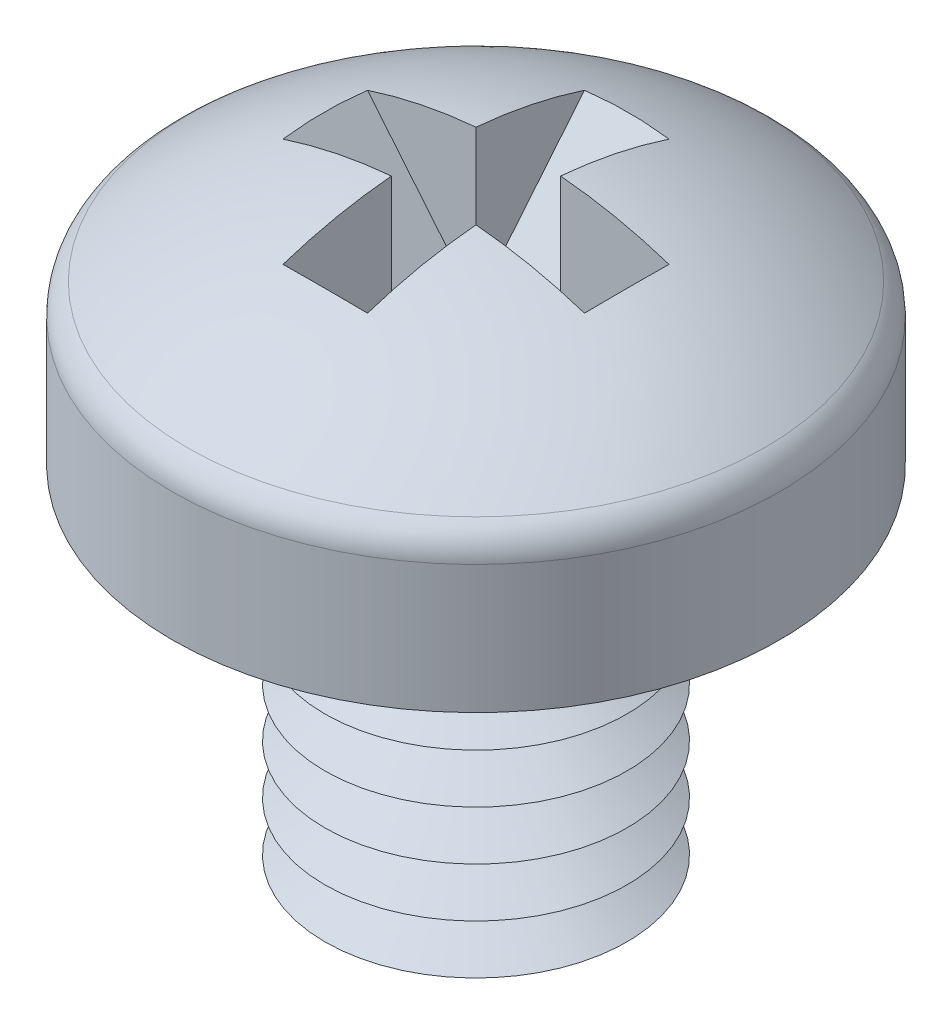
ISO-10303-21;
HEADER;
FILE_DESCRIPTION(('STEP AP214'),'2;1');
FILE_NAME('part.step','',(''),(''),'','','');
FILE_SCHEMA(('AUTOMOTIVE_DESIGN { 1 0 10303 214 1 1 1 1 }'));
ENDSEC;
DATA;
#1=APPLICATION_CONTEXT('core data for automotive mechanical design processes');
#2=APPLICATION_PROTOCOL_DEFINITION('international standard','automotive_design',2000,#1);
#3=PRODUCT_CONTEXT('',#1,'mechanical');
#4=PRODUCT('Part','Part','',(#3));
#5=PRODUCT_RELATED_PRODUCT_CATEGORY('part','',(#4));
#6=PRODUCT_DEFINITION_FORMATION('','',#4);
#7=PRODUCT_DEFINITION_CONTEXT('part definition',#1,'design');
#8=PRODUCT_DEFINITION('design','',#6,#7);
#9=PRODUCT_DEFINITION_SHAPE('','',#8);
#10=(LENGTH_UNIT() NAMED_UNIT(*) SI_UNIT(.MILLI.,.METRE.));
#11=(NAMED_UNIT(*) PLANE_ANGLE_UNIT() SI_UNIT($,.RADIAN.));
#12=(NAMED_UNIT(*) SI_UNIT($,.STERADIAN.) SOLID_ANGLE_UNIT());
#13=UNCERTAINTY_MEASURE_WITH_UNIT(LENGTH_MEASURE(1.E-05),#10,'distance_accuracy_value','');
#14=(GEOMETRIC_REPRESENTATION_CONTEXT(3) GLOBAL_UNCERTAINTY_ASSIGNED_CONTEXT((#13)) GLOBAL_UNIT_ASSIGNED_CONTEXT((#10,
#11,#12)) REPRESENTATION_CONTEXT('',''));
#15=CARTESIAN_POINT('',(0.,0.,0.));
#16=DIRECTION('',(0.,0.,1.));
#17=DIRECTION('',(1.,0.,0.));
#18=AXIS2_PLACEMENT_3D('',#15,#16,#17);
#19=CARTESIAN_POINT('',(1.425,2.1,-0.35));
#20=DIRECTION('',(0.771865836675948,-0.635785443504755,0.));
#21=DIRECTION('',(0.635785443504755,0.771865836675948,0.));
#22=AXIS2_PLACEMENT_3D('',#19,#20,#21);
#23=PLANE('',#22);
#24=DIRECTION('',(0.,0.,-1.));
#25=VECTOR('',#24,1.);
#26=CARTESIAN_POINT('',(0.35,0.794912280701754,-0.35));
#27=LINE('',#26,#25);
#28=CARTESIAN_POINT('',(0.35,0.794912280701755,0.35));
#29=VERTEX_POINT('',#28);
#30=CARTESIAN_POINT('',(0.35,0.794912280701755,-0.35));
#31=VERTEX_POINT('',#30);
#32=EDGE_CURVE('E137',#29,#31,#27,.T.);
#33=ORIENTED_EDGE('',*,*,#32,.F.);
#34=DIRECTION('',(0.635785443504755,0.771865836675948,0.));
#35=VECTOR('',#34,1.);
#36=CARTESIAN_POINT('',(1.425,2.1,0.35));
#37=LINE('',#36,#35);
#38=CARTESIAN_POINT('',(1.24787904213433,1.88496894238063,0.35));
#39=VERTEX_POINT('',#38);
#40=EDGE_CURVE('E178',#29,#39,#37,.T.);
#41=ORIENTED_EDGE('',*,*,#40,.T.);
#42=CARTESIAN_POINT('',(-1.12047731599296,-0.990298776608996,0.));
#43=DIRECTION('',(0.771865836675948,-0.635785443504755,0.));
#44=DIRECTION('',(0.635785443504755,0.771865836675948,0.));
#45=AXIS2_PLACEMENT_3D('',#42,#43,#44);
#46=CIRCLE('',#45,3.74149385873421);
#47=CARTESIAN_POINT('',(1.24787904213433,1.88496894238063,-0.35));
#48=VERTEX_POINT('',#47);
#49=EDGE_CURVE('E259',#39,#48,#46,.F.);
#50=ORIENTED_EDGE('',*,*,#49,.T.);
#51=DIRECTION('',(0.635785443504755,0.771865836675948,0.));
#52=VECTOR('',#51,1.);
#53=CARTESIAN_POINT('',(1.425,2.1,-0.35));
#54=LINE('',#53,#52);
#55=EDGE_CURVE('E184',#31,#48,#54,.T.);
#56=ORIENTED_EDGE('',*,*,#55,.F.);
#57=EDGE_LOOP('',(#33,#41,#50,#56));
#58=FACE_BOUND('',#57,.T.);
#59=ADVANCED_FACE('F31',(#58),#23,.F.);
#60=CARTESIAN_POINT('',(-1.425,3.15,-0.35));
#61=DIRECTION('',(0.,0.,-1.));
#62=DIRECTION('',(-1.,0.,0.));
#63=AXIS2_PLACEMENT_3D('',#60,#61,#62);
#64=PLANE('',#63);
#65=DIRECTION('',(0.635785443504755,-0.771865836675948,0.));
#66=VECTOR('',#65,1.);
#67=CARTESIAN_POINT('',(0.,0.37,-0.35));
#68=LINE('',#67,#66);
#69=CARTESIAN_POINT('',(-1.24787904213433,1.88496894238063,-0.35));
#70=VERTEX_POINT('',#69);
#71=CARTESIAN_POINT('',(-0.35,0.794912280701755,-0.35));
#72=VERTEX_POINT('',#71);
#73=EDGE_CURVE('E182',#70,#72,#68,.T.);
#74=ORIENTED_EDGE('',*,*,#73,.T.);
#75=DIRECTION('',(0.,1.,0.));
#76=VECTOR('',#75,1.);
#77=CARTESIAN_POINT('',(-0.35,3.15,-0.35));
#78=LINE('',#77,#76);
#79=CARTESIAN_POINT('',(-0.35,2.06935902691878,-0.35));
#80=VERTEX_POINT('',#79);
#81=EDGE_CURVE('E158',#72,#80,#78,.T.);
#82=ORIENTED_EDGE('',*,*,#81,.T.);
#83=CARTESIAN_POINT('',(0.,-1.91323529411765,-0.35));
#84=DIRECTION('',(0.,0.,-1.));
#85=DIRECTION('',(-1.,0.,0.));
#86=AXIS2_PLACEMENT_3D('',#83,#84,#85);
#87=CIRCLE('',#86,3.99794416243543);
#88=EDGE_CURVE('E262',#80,#70,#87,.F.);
#89=ORIENTED_EDGE('',*,*,#88,.T.);
#90=EDGE_LOOP('',(#74,#82,#89));
#91=FACE_BOUND('',#90,.T.);
#92=ADVANCED_FACE('F290',(#91),#64,.F.);
#93=DIRECTION('',(0.,1.,0.));
#94=VECTOR('',#93,1.);
#95=CARTESIAN_POINT('',(0.35,3.15,-0.35));
#96=LINE('',#95,#94);
#97=CARTESIAN_POINT('',(0.35,2.06935902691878,-0.35));
#98=VERTEX_POINT('',#97);
#99=EDGE_CURVE('E150',#31,#98,#96,.T.);
#100=ORIENTED_EDGE('',*,*,#99,.F.);
#101=ORIENTED_EDGE('',*,*,#55,.T.);
#102=EDGE_CURVE('E263',#48,#98,#87,.F.);
#103=ORIENTED_EDGE('',*,*,#102,.T.);
#104=EDGE_LOOP('',(#100,#101,#103));
#105=FACE_BOUND('',#104,.T.);
#106=ADVANCED_FACE('F318',(#105),#64,.F.);
#107=CARTESIAN_POINT('',(-1.425,3.15,0.35));
#108=DIRECTION('',(0.,0.,-1.));
#109=DIRECTION('',(-1.,0.,0.));
#110=AXIS2_PLACEMENT_3D('',#107,#108,#109);
#111=PLANE('',#110);
#112=DIRECTION('',(0.,1.,0.));
#113=VECTOR('',#112,1.);
#114=CARTESIAN_POINT('',(-0.35,3.15,0.35));
#115=LINE('',#114,#113);
#116=CARTESIAN_POINT('',(-0.35,0.794912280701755,0.35));
#117=VERTEX_POINT('',#116);
#118=CARTESIAN_POINT('',(-0.35,2.06935902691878,0.35));
#119=VERTEX_POINT('',#118);
#120=EDGE_CURVE('E39',#117,#119,#115,.T.);
#121=ORIENTED_EDGE('',*,*,#120,.F.);
#122=DIRECTION('',(0.635785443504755,-0.771865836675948,0.));
#123=VECTOR('',#122,1.);
#124=CARTESIAN_POINT('',(0.,0.37,0.35));
#125=LINE('',#124,#123);
#126=CARTESIAN_POINT('',(-1.24787904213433,1.88496894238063,0.35));
#127=VERTEX_POINT('',#126);
#128=EDGE_CURVE('E175',#127,#117,#125,.T.);
#129=ORIENTED_EDGE('',*,*,#128,.F.);
#130=CARTESIAN_POINT('',(0.,-1.91323529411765,0.35));
#131=DIRECTION('',(0.,0.,-1.));
#132=DIRECTION('',(-1.,0.,0.));
#133=AXIS2_PLACEMENT_3D('',#130,#131,#132);
#134=CIRCLE('',#133,3.99794416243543);
#135=EDGE_CURVE('E196',#119,#127,#134,.F.);
#136=ORIENTED_EDGE('',*,*,#135,.F.);
#137=EDGE_LOOP('',(#121,#129,#136));
#138=FACE_BOUND('',#137,.T.);
#139=ADVANCED_FACE('F282',(#138),#111,.T.);
#140=ORIENTED_EDGE('',*,*,#40,.F.);
#141=DIRECTION('',(0.,1.,0.));
#142=VECTOR('',#141,1.);
#143=CARTESIAN_POINT('',(0.35,3.15,0.35));
#144=LINE('',#143,#142);
#145=CARTESIAN_POINT('',(0.35,2.06935902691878,0.35));
#146=VERTEX_POINT('',#145);
#147=EDGE_CURVE('E266',#29,#146,#144,.T.);
#148=ORIENTED_EDGE('',*,*,#147,.T.);
#149=EDGE_CURVE('E253',#39,#146,#134,.F.);
#150=ORIENTED_EDGE('',*,*,#149,.F.);
#151=EDGE_LOOP('',(#140,#148,#150));
#152=FACE_BOUND('',#151,.T.);
#153=ADVANCED_FACE('F323',(#152),#111,.T.);
#154=CARTESIAN_POINT('',(0.,0.,0.));
#155=DIRECTION('',(0.,-1.,0.));
#156=DIRECTION('',(0.,0.,-1.));
#157=AXIS2_PLACEMENT_3D('',#154,#155,#156);
#158=PLANE('',#157);
#159=CARTESIAN_POINT('',(0.,0.,0.));
#160=DIRECTION('',(0.,-1.,0.));
#161=DIRECTION('',(0.,0.,-1.));
#162=AXIS2_PLACEMENT_3D('',#159,#160,#161);
#163=CIRCLE('',#162,1.25);
#164=CARTESIAN_POINT('',(0.,0.,-1.25));
#165=VERTEX_POINT('',#164);
#166=EDGE_CURVE('E193',#165,#165,#163,.T.);
#167=ORIENTED_EDGE('',*,*,#166,.F.);
#168=EDGE_LOOP('',(#167));
#169=FACE_BOUND('',#168,.T.);
#170=CARTESIAN_POINT('',(0.,0.,0.));
#171=DIRECTION('',(0.,-1.,0.));
#172=DIRECTION('',(0.,0.,-1.));
#173=AXIS2_PLACEMENT_3D('',#170,#171,#172);
#174=CIRCLE('',#173,2.51323529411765);
#175=CARTESIAN_POINT('',(0.,0.,-2.51323529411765));
#176=VERTEX_POINT('',#175);
#177=EDGE_CURVE('E197',#176,#176,#174,.T.);
#178=ORIENTED_EDGE('',*,*,#177,.T.);
#179=EDGE_LOOP('',(#178));
#180=FACE_BOUND('',#179,.T.);
#181=ADVANCED_FACE('F33',(#169,#180),#158,.T.);
#182=CARTESIAN_POINT('',(0.,0.,0.));
#183=DIRECTION('',(0.,-1.,0.));
#184=DIRECTION('',(0.,0.,-1.));
#185=AXIS2_PLACEMENT_3D('',#182,#183,#184);
#186=CYLINDRICAL_SURFACE('',#185,2.51323529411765);
#187=CARTESIAN_POINT('',(0.,1.06165966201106,0.));
#188=DIRECTION('',(0.,-1.,0.));
#189=DIRECTION('',(0.,0.,-1.));
#190=AXIS2_PLACEMENT_3D('',#187,#188,#189);
#191=CIRCLE('',#190,2.51323529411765);
#192=CARTESIAN_POINT('',(0.,1.06165966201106,-2.51323529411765));
#193=VERTEX_POINT('',#192);
#194=EDGE_CURVE('E248',#193,#193,#191,.T.);
#195=ORIENTED_EDGE('',*,*,#194,.T.);
#196=EDGE_LOOP('',(#195));
#197=FACE_BOUND('',#196,.T.);
#198=ORIENTED_EDGE('',*,*,#177,.F.);
#199=EDGE_LOOP('',(#198));
#200=FACE_BOUND('',#199,.T.);
#201=ADVANCED_FACE('F454',(#197,#200),#186,.T.);
#202=CARTESIAN_POINT('',(0.,1.06165966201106,0.));
#203=DIRECTION('',(0.,-1.,0.));
#204=DIRECTION('',(0.,0.,-1.));
#205=AXIS2_PLACEMENT_3D('',#202,#203,#204);
#206=TOROIDAL_SURFACE('',#205,2.2,0.313235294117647);
#207=CARTESIAN_POINT('',(0.,1.3135088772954,0.));
#208=DIRECTION('',(0.,-1.,0.));
#209=DIRECTION('',(0.,0.,-1.));
#210=AXIS2_PLACEMENT_3D('',#207,#208,#209);
#211=CIRCLE('',#210,2.3862480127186);
#212=CARTESIAN_POINT('',(0.,1.3135088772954,-2.3862480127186));
#213=VERTEX_POINT('',#212);
#214=EDGE_CURVE('E245',#213,#213,#211,.T.);
#215=ORIENTED_EDGE('',*,*,#214,.T.);
#216=EDGE_LOOP('',(#215));
#217=FACE_BOUND('',#216,.T.);
#218=ORIENTED_EDGE('',*,*,#194,.F.);
#219=EDGE_LOOP('',(#218));
#220=FACE_BOUND('',#219,.T.);
#221=ADVANCED_FACE('F452',(#217,#220),#206,.T.);
#222=CARTESIAN_POINT('',(0.,-1.91323529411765,0.));
#223=DIRECTION('',(0.,0.,1.));
#224=DIRECTION('',(1.,0.,0.));
#225=AXIS2_PLACEMENT_3D('',#222,#223,#224);
#226=SPHERICAL_SURFACE('',#225,4.01323529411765);
#227=CARTESIAN_POINT('',(-0.35,-1.91323529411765,0.));
#228=DIRECTION('',(-1.,0.,0.));
#229=DIRECTION('',(0.,0.,1.));
#230=AXIS2_PLACEMENT_3D('',#227,#228,#229);
#231=CIRCLE('',#230,3.99794416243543);
#232=CARTESIAN_POINT('',(-0.35,1.88496894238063,-1.24787904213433));
#233=VERTEX_POINT('',#232);
#234=EDGE_CURVE('E159',#233,#80,#231,.F.);
#235=ORIENTED_EDGE('',*,*,#234,.F.);
#236=CARTESIAN_POINT('',(0.,-0.990298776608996,1.12047731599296));
#237=DIRECTION('',(0.,-0.635785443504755,-0.771865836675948));
#238=DIRECTION('',(0.,0.771865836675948,-0.635785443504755));
#239=AXIS2_PLACEMENT_3D('',#236,#237,#238);
#240=CIRCLE('',#239,3.74149385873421);
#241=CARTESIAN_POINT('',(0.35,1.88496894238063,-1.24787904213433));
#242=VERTEX_POINT('',#241);
#243=EDGE_CURVE('E172',#242,#233,#240,.F.);
#244=ORIENTED_EDGE('',*,*,#243,.F.);
#245=CARTESIAN_POINT('',(0.35,-1.91323529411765,0.));
#246=DIRECTION('',(-1.,0.,0.));
#247=DIRECTION('',(0.,0.,1.));
#248=AXIS2_PLACEMENT_3D('',#245,#246,#247);
#249=CIRCLE('',#248,3.99794416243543);
#250=EDGE_CURVE('E151',#242,#98,#249,.F.);
#251=ORIENTED_EDGE('',*,*,#250,.T.);
#252=ORIENTED_EDGE('',*,*,#102,.F.);
#253=ORIENTED_EDGE('',*,*,#49,.F.);
#254=ORIENTED_EDGE('',*,*,#149,.T.);
#255=CARTESIAN_POINT('',(0.35,1.88496894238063,1.24787904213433));
#256=VERTEX_POINT('',#255);
#257=EDGE_CURVE('E147',#146,#256,#249,.F.);
#258=ORIENTED_EDGE('',*,*,#257,.T.);
#259=CARTESIAN_POINT('',(0.,-0.990298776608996,-1.12047731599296));
#260=DIRECTION('',(0.,-0.635785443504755,0.771865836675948));
#261=DIRECTION('',(0.,-0.771865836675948,-0.635785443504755));
#262=AXIS2_PLACEMENT_3D('',#259,#260,#261);
#263=CIRCLE('',#262,3.74149385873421);
#264=CARTESIAN_POINT('',(-0.35,1.88496894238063,1.24787904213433));
#265=VERTEX_POINT('',#264);
#266=EDGE_CURVE('E166',#265,#256,#263,.F.);
#267=ORIENTED_EDGE('',*,*,#266,.F.);
#268=EDGE_CURVE('E156',#119,#265,#231,.F.);
#269=ORIENTED_EDGE('',*,*,#268,.F.);
#270=ORIENTED_EDGE('',*,*,#135,.T.);
#271=CARTESIAN_POINT('',(1.12047731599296,-0.990298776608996,0.));
#272=DIRECTION('',(-0.771865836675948,-0.635785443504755,0.));
#273=DIRECTION('',(0.635785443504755,-0.771865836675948,0.));
#274=AXIS2_PLACEMENT_3D('',#271,#272,#273);
#275=CIRCLE('',#274,3.74149385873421);
#276=EDGE_CURVE('E256',#70,#127,#275,.F.);
#277=ORIENTED_EDGE('',*,*,#276,.F.);
#278=ORIENTED_EDGE('',*,*,#88,.F.);
#279=EDGE_LOOP('',(#235,#244,#251,#252,#253,#254,#258,#267,#269,#270,#277,#278));
#280=FACE_BOUND('',#279,.T.);
#281=ORIENTED_EDGE('',*,*,#214,.F.);
#282=EDGE_LOOP('',(#281));
#283=FACE_BOUND('',#282,.T.);
#284=ADVANCED_FACE('F279',(#280,#283),#226,.T.);
#285=CARTESIAN_POINT('',(0.,-3.,0.));
#286=DIRECTION('',(0.,-1.,0.));
#287=DIRECTION('',(0.,0.,-1.));
#288=AXIS2_PLACEMENT_3D('',#285,#286,#287);
#289=PLANE('',#288);
#290=CARTESIAN_POINT('',(0.,-3.,0.));
#291=DIRECTION('',(0.,-1.,0.));
#292=DIRECTION('',(0.,0.,-1.));
#293=AXIS2_PLACEMENT_3D('',#290,#291,#292);
#294=CIRCLE('',#293,0.8963675);
#295=CARTESIAN_POINT('',(0.,-3.,-0.8963675));
#296=VERTEX_POINT('',#295);
#297=EDGE_CURVE('E242',#296,#296,#294,.T.);
#298=ORIENTED_EDGE('',*,*,#297,.T.);
#299=EDGE_LOOP('',(#298));
#300=FACE_BOUND('',#299,.T.);
#301=ADVANCED_FACE('F445',(#300),#289,.T.);
#302=CARTESIAN_POINT('',(0.,-3.,0.));
#303=DIRECTION('',(0.,1.,0.));
#304=DIRECTION('',(0.,0.,1.));
#305=AXIS2_PLACEMENT_3D('',#302,#303,#304);
#306=CONICAL_SURFACE('',#305,0.8963675,1.0471975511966);
#307=CARTESIAN_POINT('',(0.,-2.7958301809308,0.));
#308=DIRECTION('',(0.,-1.,0.));
#309=DIRECTION('',(0.,0.,-1.));
#310=AXIS2_PLACEMENT_3D('',#307,#308,#309);
#311=CIRCLE('',#310,1.25);
#312=CARTESIAN_POINT('',(0.,-2.7958301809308,-1.25));
#313=VERTEX_POINT('',#312);
#314=EDGE_CURVE('E239',#313,#313,#311,.T.);
#315=ORIENTED_EDGE('',*,*,#314,.T.);
#316=EDGE_LOOP('',(#315));
#317=FACE_BOUND('',#316,.T.);
#318=ORIENTED_EDGE('',*,*,#297,.F.);
#319=EDGE_LOOP('',(#318));
#320=FACE_BOUND('',#319,.T.);
#321=ADVANCED_FACE('F441',(#317,#320),#306,.T.);
#322=CARTESIAN_POINT('',(0.,-2.7958301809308,0.));
#323=DIRECTION('',(0.,-1.,0.));
#324=DIRECTION('',(0.,0.,-1.));
#325=AXIS2_PLACEMENT_3D('',#322,#323,#324);
#326=CONICAL_SURFACE('',#325,1.25,1.0471975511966);
#327=CARTESIAN_POINT('',(0.,-2.5916603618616,0.));
#328=DIRECTION('',(0.,-1.,0.));
#329=DIRECTION('',(0.,0.,-1.));
#330=AXIS2_PLACEMENT_3D('',#327,#328,#329);
#331=CIRCLE('',#330,0.8963675);
#332=CARTESIAN_POINT('',(0.,-2.5916603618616,-0.8963675));
#333=VERTEX_POINT('',#332);
#334=EDGE_CURVE('E236',#333,#333,#331,.T.);
#335=ORIENTED_EDGE('',*,*,#334,.T.);
#336=EDGE_LOOP('',(#335));
#337=FACE_BOUND('',#336,.T.);
#338=ORIENTED_EDGE('',*,*,#314,.F.);
#339=EDGE_LOOP('',(#338));
#340=FACE_BOUND('',#339,.T.);
#341=ADVANCED_FACE('F437',(#337,#340),#326,.T.);
#342=CARTESIAN_POINT('',(0.,-2.5916603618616,0.));
#343=DIRECTION('',(0.,1.,0.));
#344=DIRECTION('',(0.,0.,1.));
#345=AXIS2_PLACEMENT_3D('',#342,#343,#344);
#346=CONICAL_SURFACE('',#345,0.8963675,1.0471975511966);
#347=CARTESIAN_POINT('',(0.,-2.3874905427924,0.));
#348=DIRECTION('',(0.,-1.,0.));
#349=DIRECTION('',(0.,0.,-1.));
#350=AXIS2_PLACEMENT_3D('',#347,#348,#349);
#351=CIRCLE('',#350,1.25);
#352=CARTESIAN_POINT('',(0.,-2.3874905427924,-1.25));
#353=VERTEX_POINT('',#352);
#354=EDGE_CURVE('E233',#353,#353,#351,.T.);
#355=ORIENTED_EDGE('',*,*,#354,.T.);
#356=EDGE_LOOP('',(#355));
#357=FACE_BOUND('',#356,.T.);
#358=ORIENTED_EDGE('',*,*,#334,.F.);
#359=EDGE_LOOP('',(#358));
#360=FACE_BOUND('',#359,.T.);
#361=ADVANCED_FACE('F433',(#357,#360),#346,.T.);
#362=CARTESIAN_POINT('',(0.,-2.3874905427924,0.));
#363=DIRECTION('',(0.,-1.,0.));
#364=DIRECTION('',(0.,0.,-1.));
#365=AXIS2_PLACEMENT_3D('',#362,#363,#364);
#366=CONICAL_SURFACE('',#365,1.25,1.0471975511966);
#367=CARTESIAN_POINT('',(0.,-2.1833207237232,0.));
#368=DIRECTION('',(0.,-1.,0.));
#369=DIRECTION('',(0.,0.,-1.));
#370=AXIS2_PLACEMENT_3D('',#367,#368,#369);
#371=CIRCLE('',#370,0.8963675);
#372=CARTESIAN_POINT('',(0.,-2.1833207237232,-0.8963675));
#373=VERTEX_POINT('',#372);
#374=EDGE_CURVE('E230',#373,#373,#371,.T.);
#375=ORIENTED_EDGE('',*,*,#374,.T.);
#376=EDGE_LOOP('',(#375));
#377=FACE_BOUND('',#376,.T.);
#378=ORIENTED_EDGE('',*,*,#354,.F.);
#379=EDGE_LOOP('',(#378));
#380=FACE_BOUND('',#379,.T.);
#381=ADVANCED_FACE('F429',(#377,#380),#366,.T.);
#382=CARTESIAN_POINT('',(0.,-2.1833207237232,0.));
#383=DIRECTION('',(0.,1.,0.));
#384=DIRECTION('',(0.,0.,1.));
#385=AXIS2_PLACEMENT_3D('',#382,#383,#384);
#386=CONICAL_SURFACE('',#385,0.8963675,1.0471975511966);
#387=CARTESIAN_POINT('',(0.,-1.979150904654,0.));
#388=DIRECTION('',(0.,-1.,0.));
#389=DIRECTION('',(0.,0.,-1.));
#390=AXIS2_PLACEMENT_3D('',#387,#388,#389);
#391=CIRCLE('',#390,1.25);
#392=CARTESIAN_POINT('',(0.,-1.979150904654,-1.25));
#393=VERTEX_POINT('',#392);
#394=EDGE_CURVE('E227',#393,#393,#391,.T.);
#395=ORIENTED_EDGE('',*,*,#394,.T.);
#396=EDGE_LOOP('',(#395));
#397=FACE_BOUND('',#396,.T.);
#398=ORIENTED_EDGE('',*,*,#374,.F.);
#399=EDGE_LOOP('',(#398));
#400=FACE_BOUND('',#399,.T.);
#401=ADVANCED_FACE('F425',(#397,#400),#386,.T.);
#402=CARTESIAN_POINT('',(0.,-1.979150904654,0.));
#403=DIRECTION('',(0.,-1.,0.));
#404=DIRECTION('',(0.,0.,-1.));
#405=AXIS2_PLACEMENT_3D('',#402,#403,#404);
#406=CONICAL_SURFACE('',#405,1.25,1.0471975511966);
#407=CARTESIAN_POINT('',(0.,-1.7749810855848,0.));
#408=DIRECTION('',(0.,-1.,0.));
#409=DIRECTION('',(0.,0.,-1.));
#410=AXIS2_PLACEMENT_3D('',#407,#408,#409);
#411=CIRCLE('',#410,0.8963675);
#412=CARTESIAN_POINT('',(0.,-1.7749810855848,-0.8963675));
#413=VERTEX_POINT('',#412);
#414=EDGE_CURVE('E224',#413,#413,#411,.T.);
#415=ORIENTED_EDGE('',*,*,#414,.T.);
#416=EDGE_LOOP('',(#415));
#417=FACE_BOUND('',#416,.T.);
#418=ORIENTED_EDGE('',*,*,#394,.F.);
#419=EDGE_LOOP('',(#418));
#420=FACE_BOUND('',#419,.T.);
#421=ADVANCED_FACE('F421',(#417,#420),#406,.T.);
#422=CARTESIAN_POINT('',(0.,-1.7749810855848,0.));
#423=DIRECTION('',(0.,1.,0.));
#424=DIRECTION('',(0.,0.,1.));
#425=AXIS2_PLACEMENT_3D('',#422,#423,#424);
#426=CONICAL_SURFACE('',#425,0.8963675,1.0471975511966);
#427=CARTESIAN_POINT('',(0.,-1.5708112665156,0.));
#428=DIRECTION('',(0.,-1.,0.));
#429=DIRECTION('',(0.,0.,-1.));
#430=AXIS2_PLACEMENT_3D('',#427,#428,#429);
#431=CIRCLE('',#430,1.25);
#432=CARTESIAN_POINT('',(0.,-1.5708112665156,-1.25));
#433=VERTEX_POINT('',#432);
#434=EDGE_CURVE('E221',#433,#433,#431,.T.);
#435=ORIENTED_EDGE('',*,*,#434,.T.);
#436=EDGE_LOOP('',(#435));
#437=FACE_BOUND('',#436,.T.);
#438=ORIENTED_EDGE('',*,*,#414,.F.);
#439=EDGE_LOOP('',(#438));
#440=FACE_BOUND('',#439,.T.);
#441=ADVANCED_FACE('F417',(#437,#440),#426,.T.);
#442=CARTESIAN_POINT('',(0.,-1.5708112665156,0.));
#443=DIRECTION('',(0.,-1.,0.));
#444=DIRECTION('',(0.,0.,-1.));
#445=AXIS2_PLACEMENT_3D('',#442,#443,#444);
#446=CONICAL_SURFACE('',#445,1.25,1.0471975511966);
#447=CARTESIAN_POINT('',(0.,-1.3666414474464,0.));
#448=DIRECTION('',(0.,-1.,0.));
#449=DIRECTION('',(0.,0.,-1.));
#450=AXIS2_PLACEMENT_3D('',#447,#448,#449);
#451=CIRCLE('',#450,0.8963675);
#452=CARTESIAN_POINT('',(0.,-1.3666414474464,-0.8963675));
#453=VERTEX_POINT('',#452);
#454=EDGE_CURVE('E218',#453,#453,#451,.T.);
#455=ORIENTED_EDGE('',*,*,#454,.T.);
#456=EDGE_LOOP('',(#455));
#457=FACE_BOUND('',#456,.T.);
#458=ORIENTED_EDGE('',*,*,#434,.F.);
#459=EDGE_LOOP('',(#458));
#460=FACE_BOUND('',#459,.T.);
#461=ADVANCED_FACE('F413',(#457,#460),#446,.T.);
#462=CARTESIAN_POINT('',(0.,-1.3666414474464,0.));
#463=DIRECTION('',(0.,1.,0.));
#464=DIRECTION('',(0.,0.,1.));
#465=AXIS2_PLACEMENT_3D('',#462,#463,#464);
#466=CONICAL_SURFACE('',#465,0.8963675,1.0471975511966);
#467=CARTESIAN_POINT('',(0.,-1.1624716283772,0.));
#468=DIRECTION('',(0.,-1.,0.));
#469=DIRECTION('',(0.,0.,-1.));
#470=AXIS2_PLACEMENT_3D('',#467,#468,#469);
#471=CIRCLE('',#470,1.25);
#472=CARTESIAN_POINT('',(0.,-1.1624716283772,-1.25));
#473=VERTEX_POINT('',#472);
#474=EDGE_CURVE('E215',#473,#473,#471,.T.);
#475=ORIENTED_EDGE('',*,*,#474,.T.);
#476=EDGE_LOOP('',(#475));
#477=FACE_BOUND('',#476,.T.);
#478=ORIENTED_EDGE('',*,*,#454,.F.);
#479=EDGE_LOOP('',(#478));
#480=FACE_BOUND('',#479,.T.);
#481=ADVANCED_FACE('F409',(#477,#480),#466,.T.);
#482=CARTESIAN_POINT('',(0.,-1.1624716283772,0.));
#483=DIRECTION('',(0.,-1.,0.));
#484=DIRECTION('',(0.,0.,-1.));
#485=AXIS2_PLACEMENT_3D('',#482,#483,#484);
#486=CONICAL_SURFACE('',#485,1.25,1.0471975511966);
#487=CARTESIAN_POINT('',(0.,-0.958301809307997,0.));
#488=DIRECTION('',(0.,-1.,0.));
#489=DIRECTION('',(0.,0.,-1.));
#490=AXIS2_PLACEMENT_3D('',#487,#488,#489);
#491=CIRCLE('',#490,0.8963675);
#492=CARTESIAN_POINT('',(0.,-0.958301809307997,-0.8963675));
#493=VERTEX_POINT('',#492);
#494=EDGE_CURVE('E212',#493,#493,#491,.T.);
#495=ORIENTED_EDGE('',*,*,#494,.T.);
#496=EDGE_LOOP('',(#495));
#497=FACE_BOUND('',#496,.T.);
#498=ORIENTED_EDGE('',*,*,#474,.F.);
#499=EDGE_LOOP('',(#498));
#500=FACE_BOUND('',#499,.T.);
#501=ADVANCED_FACE('F405',(#497,#500),#486,.T.);
#502=CARTESIAN_POINT('',(0.,-0.958301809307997,0.));
#503=DIRECTION('',(0.,1.,0.));
#504=DIRECTION('',(0.,0.,1.));
#505=AXIS2_PLACEMENT_3D('',#502,#503,#504);
#506=CONICAL_SURFACE('',#505,0.8963675,1.0471975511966);
#507=CARTESIAN_POINT('',(0.,-0.754131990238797,0.));
#508=DIRECTION('',(0.,-1.,0.));
#509=DIRECTION('',(0.,0.,-1.));
#510=AXIS2_PLACEMENT_3D('',#507,#508,#509);
#511=CIRCLE('',#510,1.25);
#512=CARTESIAN_POINT('',(0.,-0.754131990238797,-1.25));
#513=VERTEX_POINT('',#512);
#514=EDGE_CURVE('E209',#513,#513,#511,.T.);
#515=ORIENTED_EDGE('',*,*,#514,.T.);
#516=EDGE_LOOP('',(#515));
#517=FACE_BOUND('',#516,.T.);
#518=ORIENTED_EDGE('',*,*,#494,.F.);
#519=EDGE_LOOP('',(#518));
#520=FACE_BOUND('',#519,.T.);
#521=ADVANCED_FACE('F401',(#517,#520),#506,.T.);
#522=CARTESIAN_POINT('',(0.,-0.754131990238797,0.));
#523=DIRECTION('',(0.,-1.,0.));
#524=DIRECTION('',(0.,0.,-1.));
#525=AXIS2_PLACEMENT_3D('',#522,#523,#524);
#526=CONICAL_SURFACE('',#525,1.25,1.0471975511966);
#527=CARTESIAN_POINT('',(0.,-0.549962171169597,0.));
#528=DIRECTION('',(0.,-1.,0.));
#529=DIRECTION('',(0.,0.,-1.));
#530=AXIS2_PLACEMENT_3D('',#527,#528,#529);
#531=CIRCLE('',#530,0.8963675);
#532=CARTESIAN_POINT('',(0.,-0.549962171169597,-0.8963675));
#533=VERTEX_POINT('',#532);
#534=EDGE_CURVE('E206',#533,#533,#531,.T.);
#535=ORIENTED_EDGE('',*,*,#534,.T.);
#536=EDGE_LOOP('',(#535));
#537=FACE_BOUND('',#536,.T.);
#538=ORIENTED_EDGE('',*,*,#514,.F.);
#539=EDGE_LOOP('',(#538));
#540=FACE_BOUND('',#539,.T.);
#541=ADVANCED_FACE('F397',(#537,#540),#526,.T.);
#542=CARTESIAN_POINT('',(0.,-0.549962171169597,0.));
#543=DIRECTION('',(0.,1.,0.));
#544=DIRECTION('',(0.,0.,1.));
#545=AXIS2_PLACEMENT_3D('',#542,#543,#544);
#546=CONICAL_SURFACE('',#545,0.8963675,1.0471975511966);
#547=CARTESIAN_POINT('',(0.,-0.345792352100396,0.));
#548=DIRECTION('',(0.,-1.,0.));
#549=DIRECTION('',(0.,0.,-1.));
#550=AXIS2_PLACEMENT_3D('',#547,#548,#549);
#551=CIRCLE('',#550,1.25);
#552=CARTESIAN_POINT('',(0.,-0.345792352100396,-1.25));
#553=VERTEX_POINT('',#552);
#554=EDGE_CURVE('E203',#553,#553,#551,.T.);
#555=ORIENTED_EDGE('',*,*,#554,.T.);
#556=EDGE_LOOP('',(#555));
#557=FACE_BOUND('',#556,.T.);
#558=ORIENTED_EDGE('',*,*,#534,.F.);
#559=EDGE_LOOP('',(#558));
#560=FACE_BOUND('',#559,.T.);
#561=ADVANCED_FACE('F393',(#557,#560),#546,.T.);
#562=CARTESIAN_POINT('',(0.,-0.345792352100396,0.));
#563=DIRECTION('',(0.,-1.,0.));
#564=DIRECTION('',(0.,0.,-1.));
#565=AXIS2_PLACEMENT_3D('',#562,#563,#564);
#566=CONICAL_SURFACE('',#565,1.25,1.0471975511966);
#567=CARTESIAN_POINT('',(0.,-0.141622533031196,0.));
#568=DIRECTION('',(0.,-1.,0.));
#569=DIRECTION('',(0.,0.,-1.));
#570=AXIS2_PLACEMENT_3D('',#567,#568,#569);
#571=CIRCLE('',#570,0.8963675);
#572=CARTESIAN_POINT('',(0.,-0.141622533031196,-0.8963675));
#573=VERTEX_POINT('',#572);
#574=EDGE_CURVE('E200',#573,#573,#571,.T.);
#575=ORIENTED_EDGE('',*,*,#574,.T.);
#576=EDGE_LOOP('',(#575));
#577=FACE_BOUND('',#576,.T.);
#578=ORIENTED_EDGE('',*,*,#554,.F.);
#579=EDGE_LOOP('',(#578));
#580=FACE_BOUND('',#579,.T.);
#581=ADVANCED_FACE('F386',(#577,#580),#566,.T.);
#582=CARTESIAN_POINT('',(0.8963675,-0.141622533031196,0.));
#583=DIRECTION('',(0.,-1.,0.));
#584=DIRECTION('',(0.,0.,-1.));
#585=AXIS2_PLACEMENT_3D('',#582,#583,#584);
#586=PLANE('',#585);
#587=CARTESIAN_POINT('',(0.,-0.141622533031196,0.));
#588=DIRECTION('',(0.,-1.,0.));
#589=DIRECTION('',(0.,0.,-1.));
#590=AXIS2_PLACEMENT_3D('',#587,#588,#589);
#591=CIRCLE('',#590,1.25);
#592=CARTESIAN_POINT('',(0.,-0.141622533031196,-1.25));
#593=VERTEX_POINT('',#592);
#594=EDGE_CURVE('E192',#593,#593,#591,.T.);
#595=ORIENTED_EDGE('',*,*,#594,.T.);
#596=EDGE_LOOP('',(#595));
#597=FACE_BOUND('',#596,.T.);
#598=ORIENTED_EDGE('',*,*,#574,.F.);
#599=EDGE_LOOP('',(#598));
#600=FACE_BOUND('',#599,.T.);
#601=ADVANCED_FACE('F381',(#597,#600),#586,.T.);
#602=CARTESIAN_POINT('',(0.,0.,0.));
#603=DIRECTION('',(0.,-1.,0.));
#604=DIRECTION('',(0.,0.,-1.));
#605=AXIS2_PLACEMENT_3D('',#602,#603,#604);
#606=CYLINDRICAL_SURFACE('',#605,1.25);
#607=ORIENTED_EDGE('',*,*,#166,.T.);
#608=EDGE_LOOP('',(#607));
#609=FACE_BOUND('',#608,.T.);
#610=ORIENTED_EDGE('',*,*,#594,.F.);
#611=EDGE_LOOP('',(#610));
#612=FACE_BOUND('',#611,.T.);
#613=ADVANCED_FACE('F374',(#609,#612),#606,.T.);
#614=CARTESIAN_POINT('',(0.,0.37,-0.35));
#615=DIRECTION('',(-0.771865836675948,-0.635785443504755,0.));
#616=DIRECTION('',(0.635785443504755,-0.771865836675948,0.));
#617=AXIS2_PLACEMENT_3D('',#614,#615,#616);
#618=PLANE('',#617);
#619=ORIENTED_EDGE('',*,*,#128,.T.);
#620=DIRECTION('',(0.,0.,-1.));
#621=VECTOR('',#620,1.);
#622=CARTESIAN_POINT('',(-0.35,0.794912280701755,-0.35));
#623=LINE('',#622,#621);
#624=EDGE_CURVE('E153',#117,#72,#623,.T.);
#625=ORIENTED_EDGE('',*,*,#624,.T.);
#626=ORIENTED_EDGE('',*,*,#73,.F.);
#627=ORIENTED_EDGE('',*,*,#276,.T.);
#628=EDGE_LOOP('',(#619,#625,#626,#627));
#629=FACE_BOUND('',#628,.T.);
#630=ADVANCED_FACE('F286',(#629),#618,.F.);
#631=CARTESIAN_POINT('',(0.35,3.15,1.425));
#632=DIRECTION('',(-1.,0.,0.));
#633=DIRECTION('',(0.,0.,1.));
#634=AXIS2_PLACEMENT_3D('',#631,#632,#633);
#635=PLANE('',#634);
#636=ORIENTED_EDGE('',*,*,#147,.F.);
#637=DIRECTION('',(0.,-0.771865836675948,-0.635785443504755));
#638=VECTOR('',#637,1.);
#639=CARTESIAN_POINT('',(0.35,0.37,0.));
#640=LINE('',#639,#638);
#641=EDGE_CURVE('E133',#256,#29,#640,.T.);
#642=ORIENTED_EDGE('',*,*,#641,.F.);
#643=ORIENTED_EDGE('',*,*,#257,.F.);
#644=EDGE_LOOP('',(#636,#642,#643));
#645=FACE_BOUND('',#644,.T.);
#646=ADVANCED_FACE('F327',(#645),#635,.T.);
#647=CARTESIAN_POINT('',(-0.35,3.15,1.425));
#648=DIRECTION('',(-1.,0.,0.));
#649=DIRECTION('',(0.,0.,1.));
#650=AXIS2_PLACEMENT_3D('',#647,#648,#649);
#651=PLANE('',#650);
#652=ORIENTED_EDGE('',*,*,#268,.T.);
#653=DIRECTION('',(0.,-0.771865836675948,-0.635785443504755));
#654=VECTOR('',#653,1.);
#655=CARTESIAN_POINT('',(-0.35,0.37,0.));
#656=LINE('',#655,#654);
#657=EDGE_CURVE('E54',#265,#117,#656,.T.);
#658=ORIENTED_EDGE('',*,*,#657,.T.);
#659=ORIENTED_EDGE('',*,*,#120,.T.);
#660=EDGE_LOOP('',(#652,#658,#659));
#661=FACE_BOUND('',#660,.T.);
#662=ADVANCED_FACE('F272',(#661),#651,.F.);
#663=CARTESIAN_POINT('',(-0.35,0.37,0.));
#664=DIRECTION('',(0.,-0.635785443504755,0.771865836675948));
#665=DIRECTION('',(0.,-0.771865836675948,-0.635785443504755));
#666=AXIS2_PLACEMENT_3D('',#663,#664,#665);
#667=PLANE('',#666);
#668=ORIENTED_EDGE('',*,*,#266,.T.);
#669=ORIENTED_EDGE('',*,*,#641,.T.);
#670=DIRECTION('',(-1.,0.,0.));
#671=VECTOR('',#670,1.);
#672=CARTESIAN_POINT('',(-1.425,0.794912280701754,0.35));
#673=LINE('',#672,#671);
#674=EDGE_CURVE('E269',#29,#117,#673,.T.);
#675=ORIENTED_EDGE('',*,*,#674,.T.);
#676=ORIENTED_EDGE('',*,*,#657,.F.);
#677=EDGE_LOOP('',(#668,#669,#675,#676));
#678=FACE_BOUND('',#677,.T.);
#679=ADVANCED_FACE('F330',(#678),#667,.F.);
#680=ORIENTED_EDGE('',*,*,#674,.F.);
#681=CARTESIAN_POINT('',(0.,0.37,0.35));
#682=VERTEX_POINT('',#681);
#683=EDGE_CURVE('E179',#682,#29,#37,.T.);
#684=ORIENTED_EDGE('',*,*,#683,.F.);
#685=EDGE_CURVE('E174',#117,#682,#125,.T.);
#686=ORIENTED_EDGE('',*,*,#685,.F.);
#687=EDGE_LOOP('',(#680,#684,#686));
#688=FACE_BOUND('',#687,.T.);
#689=ADVANCED_FACE('F334',(#688),#111,.T.);
#690=DIRECTION('',(0.,0.,1.));
#691=VECTOR('',#690,1.);
#692=CARTESIAN_POINT('',(0.,0.37,-0.35));
#693=LINE('',#692,#691);
#694=CARTESIAN_POINT('',(0.,0.37,0.));
#695=VERTEX_POINT('',#694);
#696=EDGE_CURVE('E188',#695,#682,#693,.T.);
#697=ORIENTED_EDGE('',*,*,#696,.F.);
#698=DIRECTION('',(-0.536528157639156,0.651364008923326,0.536528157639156));
#699=VECTOR('',#698,1.);
#700=CARTESIAN_POINT('',(0.100751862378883,0.24768370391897,-0.100751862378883));
#701=LINE('',#700,#699);
#702=EDGE_CURVE('E162',#695,#117,#701,.T.);
#703=ORIENTED_EDGE('',*,*,#702,.T.);
#704=ORIENTED_EDGE('',*,*,#685,.T.);
#705=EDGE_LOOP('',(#697,#703,#704));
#706=FACE_BOUND('',#705,.T.);
#707=ADVANCED_FACE('F338',(#706),#618,.F.);
#708=ORIENTED_EDGE('',*,*,#683,.T.);
#709=DIRECTION('',(-0.536528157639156,-0.651364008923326,-0.536528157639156));
#710=VECTOR('',#709,1.);
#711=CARTESIAN_POINT('',(0.914044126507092,1.47968164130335,0.914044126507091));
#712=LINE('',#711,#710);
#713=EDGE_CURVE('E129',#29,#695,#712,.T.);
#714=ORIENTED_EDGE('',*,*,#713,.T.);
#715=ORIENTED_EDGE('',*,*,#696,.T.);
#716=EDGE_LOOP('',(#708,#714,#715));
#717=FACE_BOUND('',#716,.T.);
#718=ADVANCED_FACE('F355',(#717),#23,.F.);
#719=ORIENTED_EDGE('',*,*,#234,.T.);
#720=ORIENTED_EDGE('',*,*,#81,.F.);
#721=DIRECTION('',(0.,0.771865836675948,-0.635785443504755));
#722=VECTOR('',#721,1.);
#723=CARTESIAN_POINT('',(-0.35,2.1,-1.425));
#724=LINE('',#723,#722);
#725=EDGE_CURVE('E143',#72,#233,#724,.T.);
#726=ORIENTED_EDGE('',*,*,#725,.T.);
#727=EDGE_LOOP('',(#719,#720,#726));
#728=FACE_BOUND('',#727,.T.);
#729=ADVANCED_FACE('F295',(#728),#651,.F.);
#730=DIRECTION('',(0.,0.771865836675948,-0.635785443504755));
#731=VECTOR('',#730,1.);
#732=CARTESIAN_POINT('',(0.35,2.1,-1.425));
#733=LINE('',#732,#731);
#734=EDGE_CURVE('E46',#31,#242,#733,.T.);
#735=ORIENTED_EDGE('',*,*,#734,.F.);
#736=ORIENTED_EDGE('',*,*,#99,.T.);
#737=ORIENTED_EDGE('',*,*,#250,.F.);
#738=EDGE_LOOP('',(#735,#736,#737));
#739=FACE_BOUND('',#738,.T.);
#740=ADVANCED_FACE('F380',(#739),#635,.T.);
#741=CARTESIAN_POINT('',(-0.35,2.1,-1.425));
#742=DIRECTION('',(0.,-0.635785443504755,-0.771865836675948));
#743=DIRECTION('',(0.,0.771865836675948,-0.635785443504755));
#744=AXIS2_PLACEMENT_3D('',#741,#742,#743);
#745=PLANE('',#744);
#746=ORIENTED_EDGE('',*,*,#243,.T.);
#747=ORIENTED_EDGE('',*,*,#725,.F.);
#748=DIRECTION('',(-1.,0.,0.));
#749=VECTOR('',#748,1.);
#750=CARTESIAN_POINT('',(-1.425,0.794912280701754,-0.35));
#751=LINE('',#750,#749);
#752=EDGE_CURVE('E11',#31,#72,#751,.T.);
#753=ORIENTED_EDGE('',*,*,#752,.F.);
#754=ORIENTED_EDGE('',*,*,#734,.T.);
#755=EDGE_LOOP('',(#746,#747,#753,#754));
#756=FACE_BOUND('',#755,.T.);
#757=ADVANCED_FACE('F313',(#756),#745,.F.);
#758=CARTESIAN_POINT('',(0.,0.37,-0.35));
#759=VERTEX_POINT('',#758);
#760=EDGE_CURVE('E185',#759,#31,#54,.T.);
#761=ORIENTED_EDGE('',*,*,#760,.T.);
#762=ORIENTED_EDGE('',*,*,#752,.T.);
#763=EDGE_CURVE('E181',#72,#759,#68,.T.);
#764=ORIENTED_EDGE('',*,*,#763,.T.);
#765=EDGE_LOOP('',(#761,#762,#764));
#766=FACE_BOUND('',#765,.T.);
#767=ADVANCED_FACE('F311',(#766),#64,.F.);
#768=ORIENTED_EDGE('',*,*,#763,.F.);
#769=DIRECTION('',(0.536528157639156,-0.651364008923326,0.536528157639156));
#770=VECTOR('',#769,1.);
#771=CARTESIAN_POINT('',(-0.100751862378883,0.49231629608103,-0.100751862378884));
#772=LINE('',#771,#770);
#773=EDGE_CURVE('E168',#72,#695,#772,.T.);
#774=ORIENTED_EDGE('',*,*,#773,.T.);
#775=EDGE_CURVE('E189',#759,#695,#693,.T.);
#776=ORIENTED_EDGE('',*,*,#775,.F.);
#777=EDGE_LOOP('',(#768,#774,#776));
#778=FACE_BOUND('',#777,.T.);
#779=ADVANCED_FACE('F308',(#778),#618,.F.);
#780=ORIENTED_EDGE('',*,*,#775,.T.);
#781=DIRECTION('',(0.536528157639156,0.651364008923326,-0.536528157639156));
#782=VECTOR('',#781,1.);
#783=CARTESIAN_POINT('',(1.11554785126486,1.72431423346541,-1.11554785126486));
#784=LINE('',#783,#782);
#785=EDGE_CURVE('E118',#695,#31,#784,.T.);
#786=ORIENTED_EDGE('',*,*,#785,.T.);
#787=ORIENTED_EDGE('',*,*,#760,.F.);
#788=EDGE_LOOP('',(#780,#786,#787));
#789=FACE_BOUND('',#788,.T.);
#790=ADVANCED_FACE('F348',(#789),#23,.F.);
#791=CARTESIAN_POINT('',(-0.35,0.37,0.));
#792=VERTEX_POINT('',#791);
#793=EDGE_CURVE('E138',#117,#792,#656,.T.);
#794=ORIENTED_EDGE('',*,*,#793,.T.);
#795=EDGE_CURVE('E123',#792,#72,#724,.T.);
#796=ORIENTED_EDGE('',*,*,#795,.T.);
#797=ORIENTED_EDGE('',*,*,#624,.F.);
#798=EDGE_LOOP('',(#794,#796,#797));
#799=FACE_BOUND('',#798,.T.);
#800=ADVANCED_FACE('F306',(#799),#651,.F.);
#801=DIRECTION('',(1.,0.,0.));
#802=VECTOR('',#801,1.);
#803=CARTESIAN_POINT('',(-0.35,0.37,0.));
#804=LINE('',#803,#802);
#805=EDGE_CURVE('E122',#792,#695,#804,.T.);
#806=ORIENTED_EDGE('',*,*,#805,.F.);
#807=ORIENTED_EDGE('',*,*,#793,.F.);
#808=ORIENTED_EDGE('',*,*,#702,.F.);
#809=EDGE_LOOP('',(#806,#807,#808));
#810=FACE_BOUND('',#809,.T.);
#811=ADVANCED_FACE('F340',(#810),#667,.F.);
#812=ORIENTED_EDGE('',*,*,#795,.F.);
#813=ORIENTED_EDGE('',*,*,#805,.T.);
#814=ORIENTED_EDGE('',*,*,#773,.F.);
#815=EDGE_LOOP('',(#812,#813,#814));
#816=FACE_BOUND('',#815,.T.);
#817=ADVANCED_FACE('F299',(#816),#745,.F.);
#818=CARTESIAN_POINT('',(0.35,0.37,0.));
#819=VERTEX_POINT('',#818);
#820=EDGE_CURVE('E111',#695,#819,#804,.T.);
#821=ORIENTED_EDGE('',*,*,#820,.T.);
#822=EDGE_CURVE('E115',#819,#31,#733,.T.);
#823=ORIENTED_EDGE('',*,*,#822,.T.);
#824=ORIENTED_EDGE('',*,*,#785,.F.);
#825=EDGE_LOOP('',(#821,#823,#824));
#826=FACE_BOUND('',#825,.T.);
#827=ADVANCED_FACE('F113',(#826),#745,.F.);
#828=EDGE_CURVE('E126',#29,#819,#640,.T.);
#829=ORIENTED_EDGE('',*,*,#828,.T.);
#830=ORIENTED_EDGE('',*,*,#820,.F.);
#831=ORIENTED_EDGE('',*,*,#713,.F.);
#832=EDGE_LOOP('',(#829,#830,#831));
#833=FACE_BOUND('',#832,.T.);
#834=ADVANCED_FACE('F127',(#833),#667,.F.);
#835=ORIENTED_EDGE('',*,*,#32,.T.);
#836=ORIENTED_EDGE('',*,*,#822,.F.);
#837=ORIENTED_EDGE('',*,*,#828,.F.);
#838=EDGE_LOOP('',(#835,#836,#837));
#839=FACE_BOUND('',#838,.T.);
#840=ADVANCED_FACE('F135',(#839),#635,.T.);
#841=CLOSED_SHELL('',(#59,#92,#106,#139,#153,#181,#201,#221,#284,#301,#321,#341,#361,#381,#401,
#421,#441,#461,#481,#501,#521,#541,#561,#581,#601,#613,#630,#646,#662,#679,#689,#707,#718,#729,
#740,#757,#767,#779,#790,#800,#811,#817,#827,#834,#840));
#842=MANIFOLD_SOLID_BREP('B2',#841);
#843=ADVANCED_BREP_SHAPE_REPRESENTATION('',(#18,#842),#14);
#844=SHAPE_DEFINITION_REPRESENTATION(#9,#843);
ENDSEC;
END-ISO-10303-21;
